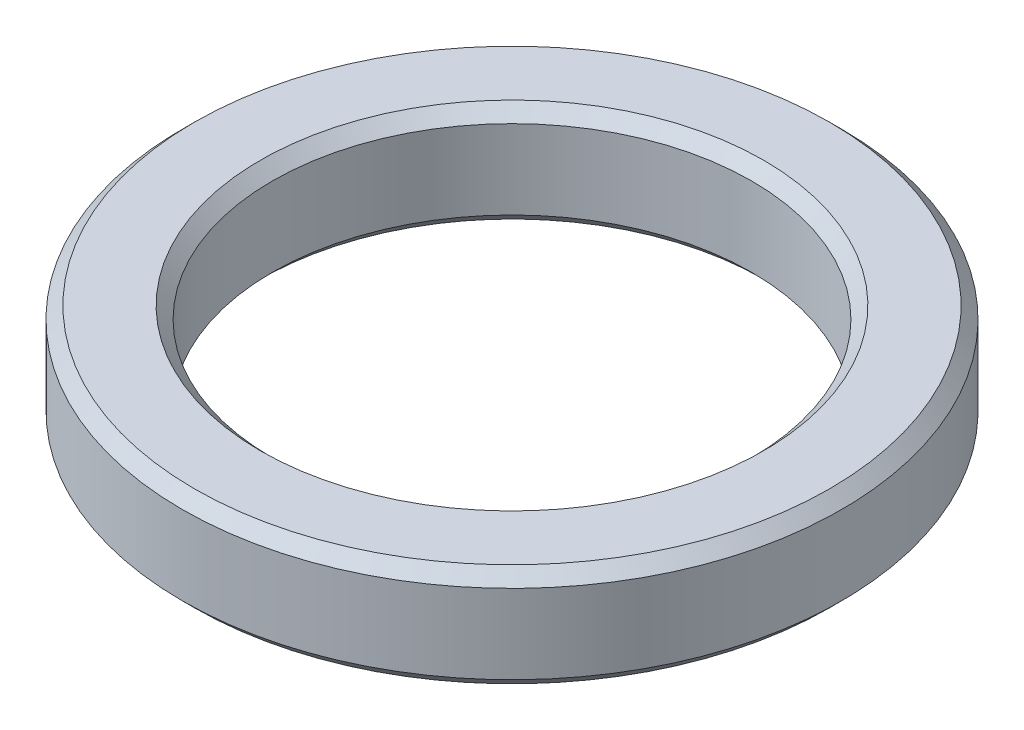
from build123d import *

# Parameters (mm, degrees)
SKIZZE1_R                       = 2.75
SKIZZE1_R_2                     = 2
AUFSATZ_LINEAR_AUSTRAGEN1_DEPTH = 0.86
FASE1_SIZE                      = 0.1


with BuildPart() as part:
    # Skizze1 → Aufsatz-Linear austragen1 (new body)
    with BuildSketch(Plane(origin=(0, 0, 0), x_dir=(1, 0, 0), z_dir=(0, 1, 0))):
        with Locations(Location((0, 0, 0), (0, 0, 270))):
            Circle(SKIZZE1_R)
        with Locations(Location((0, 0, 0), (0, 0, 270))):
            Circle(SKIZZE1_R_2, mode=Mode.SUBTRACT)
    extrude(amount=AUFSATZ_LINEAR_AUSTRAGEN1_DEPTH)

    # Fase1
    fase1_edges = [part.edges().sort_by_distance(p)[0] for p in [
        (0, 0, -2.75),
        (0, 0.86, -2.75),
        (0, 0, -2),
        (0, 0.86, -2),
    ]]
    chamfer(fase1_edges, length=FASE1_SIZE)


solid = part.part
